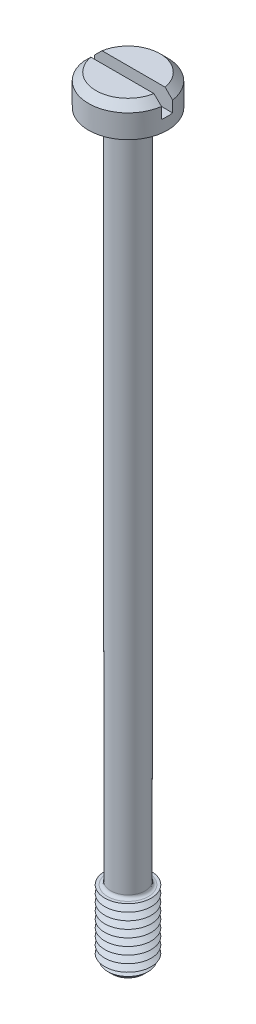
ISO-10303-21;
HEADER;
FILE_DESCRIPTION(('STEP AP214'),'2;1');
FILE_NAME('part.step','',(''),(''),'','','');
FILE_SCHEMA(('AUTOMOTIVE_DESIGN { 1 0 10303 214 1 1 1 1 }'));
ENDSEC;
DATA;
#1=APPLICATION_CONTEXT('core data for automotive mechanical design processes');
#2=APPLICATION_PROTOCOL_DEFINITION('international standard','automotive_design',2000,#1);
#3=PRODUCT_CONTEXT('',#1,'mechanical');
#4=PRODUCT('Part','Part','',(#3));
#5=PRODUCT_RELATED_PRODUCT_CATEGORY('part','',(#4));
#6=PRODUCT_DEFINITION_FORMATION('','',#4);
#7=PRODUCT_DEFINITION_CONTEXT('part definition',#1,'design');
#8=PRODUCT_DEFINITION('design','',#6,#7);
#9=PRODUCT_DEFINITION_SHAPE('','',#8);
#10=(LENGTH_UNIT() NAMED_UNIT(*) SI_UNIT(.MILLI.,.METRE.));
#11=(NAMED_UNIT(*) PLANE_ANGLE_UNIT() SI_UNIT($,.RADIAN.));
#12=(NAMED_UNIT(*) SI_UNIT($,.STERADIAN.) SOLID_ANGLE_UNIT());
#13=UNCERTAINTY_MEASURE_WITH_UNIT(LENGTH_MEASURE(1.E-05),#10,'distance_accuracy_value','');
#14=(GEOMETRIC_REPRESENTATION_CONTEXT(3) GLOBAL_UNCERTAINTY_ASSIGNED_CONTEXT((#13)) GLOBAL_UNIT_ASSIGNED_CONTEXT((#10,
#11,#12)) REPRESENTATION_CONTEXT('',''));
#15=CARTESIAN_POINT('',(0.,0.,0.));
#16=DIRECTION('',(0.,0.,1.));
#17=DIRECTION('',(1.,0.,0.));
#18=AXIS2_PLACEMENT_3D('',#15,#16,#17);
#19=CARTESIAN_POINT('',(0.,3.3,0.));
#20=DIRECTION('',(0.,1.,0.));
#21=DIRECTION('',(0.,0.,1.));
#22=AXIS2_PLACEMENT_3D('',#19,#20,#21);
#23=PLANE('',#22);
#24=DIRECTION('',(-1.,0.,0.));
#25=VECTOR('',#24,1.);
#26=CARTESIAN_POINT('',(4.25,3.3,-0.6));
#27=LINE('',#26,#25);
#28=CARTESIAN_POINT('',(3.39742549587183,3.3,-0.6));
#29=VERTEX_POINT('',#28);
#30=CARTESIAN_POINT('',(-3.39742549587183,3.3,-0.6));
#31=VERTEX_POINT('',#30);
#32=EDGE_CURVE('E110',#29,#31,#27,.T.);
#33=ORIENTED_EDGE('',*,*,#32,.F.);
#34=CARTESIAN_POINT('',(0.,3.3,0.));
#35=DIRECTION('',(0.,1.,0.));
#36=DIRECTION('',(0.,0.,1.));
#37=AXIS2_PLACEMENT_3D('',#34,#35,#36);
#38=CIRCLE('',#37,3.44999999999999);
#39=EDGE_CURVE('E113',#29,#31,#38,.T.);
#40=ORIENTED_EDGE('',*,*,#39,.T.);
#41=EDGE_LOOP('',(#33,#40));
#42=FACE_BOUND('',#41,.T.);
#43=ADVANCED_FACE('F39',(#42),#23,.T.);
#44=CARTESIAN_POINT('',(0.,3.3,0.));
#45=DIRECTION('',(0.,-1.,0.));
#46=DIRECTION('',(0.,0.,-1.));
#47=AXIS2_PLACEMENT_3D('',#44,#45,#46);
#48=CONICAL_SURFACE('',#47,3.44999999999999,0.785398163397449);
#49=CARTESIAN_POINT('',(9.35351408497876,-2.62273843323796,-0.6));
#50=CARTESIAN_POINT('',(9.03263557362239,-2.30252317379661,-0.6));
#51=CARTESIAN_POINT('',(8.7117281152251,-1.98233690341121,-0.6));
#52=CARTESIAN_POINT('',(8.069812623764,-1.34205341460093,-0.6));
#53=CARTESIAN_POINT('',(7.7488045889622,-1.02195619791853,-0.6));
#54=CARTESIAN_POINT('',(7.10652460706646,-0.381761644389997,-0.6));
#55=CARTESIAN_POINT('',(6.78525260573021,-0.0616643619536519,-0.6));
#56=CARTESIAN_POINT('',(6.14251393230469,0.578323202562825,-0.6));
#57=CARTESIAN_POINT('',(5.82104726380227,0.898213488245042,-0.6));
#58=CARTESIAN_POINT('',(5.1719620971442,1.54347500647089,-0.6));
#59=CARTESIAN_POINT('',(4.84433778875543,1.86884039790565,-0.6));
#60=CARTESIAN_POINT('',(4.35244442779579,2.35644593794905,-0.6));
#61=CARTESIAN_POINT('',(4.18839924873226,2.51891187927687,-0.6));
#62=CARTESIAN_POINT('',(3.86009606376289,2.84362679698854,-0.6));
#63=CARTESIAN_POINT('',(3.69583805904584,3.00587577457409,-0.6));
#64=CARTESIAN_POINT('',(3.36705354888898,3.33001661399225,-0.6));
#65=CARTESIAN_POINT('',(3.20252712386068,3.49190855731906,-0.6));
#66=CARTESIAN_POINT('',(2.87298689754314,3.81520272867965,-0.6));
#67=CARTESIAN_POINT('',(2.70797308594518,3.97660494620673,-0.6));
#68=CARTESIAN_POINT('',(2.37716903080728,4.29858210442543,-0.6));
#69=CARTESIAN_POINT('',(2.2113788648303,4.45915712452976,-0.6));
#70=CARTESIAN_POINT('',(1.96157219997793,4.6988460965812,-0.6));
#71=CARTESIAN_POINT('',(1.87811785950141,4.77854546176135,-0.6));
#72=CARTESIAN_POINT('',(1.71066064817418,4.93736532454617,-0.6));
#73=CARTESIAN_POINT('',(1.62665778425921,5.01648582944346,-0.6));
#74=CARTESIAN_POINT('',(1.49655488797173,5.13773269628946,-0.6));
#75=CARTESIAN_POINT('',(1.45074972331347,5.1801752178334,-0.6));
#76=CARTESIAN_POINT('',(1.35882119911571,5.26471614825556,-0.6));
#77=CARTESIAN_POINT('',(1.31269783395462,5.30681455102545,-0.6));
#78=CARTESIAN_POINT('',(1.22008852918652,5.39050695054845,-0.6));
#79=CARTESIAN_POINT('',(1.17360305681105,5.4321014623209,-0.6));
#80=CARTESIAN_POINT('',(1.08007401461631,5.51465347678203,-0.6));
#81=CARTESIAN_POINT('',(1.03303046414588,5.55561100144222,-0.6));
#82=CARTESIAN_POINT('',(0.919047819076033,5.65299331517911,-0.6));
#83=CARTESIAN_POINT('',(0.851738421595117,5.70899242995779,-0.6));
#84=CARTESIAN_POINT('',(0.748806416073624,5.79068526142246,-0.6));
#85=CARTESIAN_POINT('',(0.714125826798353,5.81756213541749,-0.6));
#86=CARTESIAN_POINT('',(0.643915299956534,5.87018079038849,-0.6));
#87=CARTESIAN_POINT('',(0.608385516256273,5.89592277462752,-0.6));
#88=CARTESIAN_POINT('',(0.545162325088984,5.93955652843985,-0.6));
#89=CARTESIAN_POINT('',(0.517718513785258,5.95780799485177,-0.6));
#90=CARTESIAN_POINT('',(0.462025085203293,5.99303174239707,-0.6));
#91=CARTESIAN_POINT('',(0.433775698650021,6.01000438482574,-0.6));
#92=CARTESIAN_POINT('',(0.376341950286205,6.04213837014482,-0.6));
#93=CARTESIAN_POINT('',(0.347160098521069,6.05730412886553,-0.6));
#94=CARTESIAN_POINT('',(0.287642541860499,6.0851339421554,-0.6));
#95=CARTESIAN_POINT('',(0.257308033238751,6.09780051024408,-0.6));
#96=CARTESIAN_POINT('',(0.190863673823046,6.12124627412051,-0.6));
#97=CARTESIAN_POINT('',(0.154554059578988,6.1314857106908,-0.6));
#98=CARTESIAN_POINT('',(0.0807909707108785,6.1456540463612,-0.6));
#99=CARTESIAN_POINT('',(0.0433423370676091,6.14960664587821,-0.6));
#100=CARTESIAN_POINT('',(-0.03179874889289,6.15033783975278,-0.6));
#101=CARTESIAN_POINT('',(-0.0694915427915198,6.14708428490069,-0.6));
#102=CARTESIAN_POINT('',(-0.143790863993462,6.13410921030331,-0.6));
#103=CARTESIAN_POINT('',(-0.180393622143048,6.1243674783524,-0.6));
#104=CARTESIAN_POINT('',(-0.254098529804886,6.09939647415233,-0.6));
#105=CARTESIAN_POINT('',(-0.291094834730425,6.0838685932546,-0.6));
#106=CARTESIAN_POINT('',(-0.363408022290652,6.0492466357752,-0.6));
#107=CARTESIAN_POINT('',(-0.398721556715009,6.03014579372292,-0.6));
#108=CARTESIAN_POINT('',(-0.468234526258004,5.98944452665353,-0.6));
#109=CARTESIAN_POINT('',(-0.502422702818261,5.96782521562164,-0.6));
#110=CARTESIAN_POINT('',(-0.569689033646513,5.92300618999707,-0.6));
#111=CARTESIAN_POINT('',(-0.602768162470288,5.89980792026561,-0.6));
#112=CARTESIAN_POINT('',(-0.671148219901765,5.85008963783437,-0.6));
#113=CARTESIAN_POINT('',(-0.706369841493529,5.82346130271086,-0.6));
#114=CARTESIAN_POINT('',(-0.776087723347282,5.76926828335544,-0.6));
#115=CARTESIAN_POINT('',(-0.810583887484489,5.74170347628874,-0.6));
#116=CARTESIAN_POINT('',(-0.913286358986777,5.6579827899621,-0.6));
#117=CARTESIAN_POINT('',(-0.98067372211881,5.60082541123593,-0.6));
#118=CARTESIAN_POINT('',(-1.11424616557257,5.48490670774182,-0.6));
#119=CARTESIAN_POINT('',(-1.18042891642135,5.42614273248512,-0.6));
#120=CARTESIAN_POINT('',(-1.31191262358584,5.30767463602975,-0.6));
#121=CARTESIAN_POINT('',(-1.37721382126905,5.24797078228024,-0.6));
#122=CARTESIAN_POINT('',(-1.50701089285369,5.12812906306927,-0.6));
#123=CARTESIAN_POINT('',(-1.57150872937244,5.06799331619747,-0.6));
#124=CARTESIAN_POINT('',(-1.70009132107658,4.94727328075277,-0.6));
#125=CARTESIAN_POINT('',(-1.76417604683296,4.88668896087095,-0.6));
#126=CARTESIAN_POINT('',(-1.95584105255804,4.70458824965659,-0.6));
#127=CARTESIAN_POINT('',(-2.08296922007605,4.58259645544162,-0.6));
#128=CARTESIAN_POINT('',(-2.33599178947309,4.33840625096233,-0.6));
#129=CARTESIAN_POINT('',(-2.46188913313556,4.21621087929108,-0.6));
#130=CARTESIAN_POINT('',(-2.71323511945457,3.97135925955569,-0.6));
#131=CARTESIAN_POINT('',(-2.83868376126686,3.84870301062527,-0.6));
#132=CARTESIAN_POINT('',(-3.21459106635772,3.48027743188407,-0.6));
#133=CARTESIAN_POINT('',(-3.46460626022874,3.23405597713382,-0.6));
#134=CARTESIAN_POINT('',(-3.96413793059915,2.74090313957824,-0.6));
#135=CARTESIAN_POINT('',(-4.21365415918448,2.49397150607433,-0.6));
#136=CARTESIAN_POINT('',(-4.71232475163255,1.9997473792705,-0.6));
#137=CARTESIAN_POINT('',(-4.96147911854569,1.75245488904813,-0.6));
#138=CARTESIAN_POINT('',(-5.45958725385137,1.25761544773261,-0.6));
#139=CARTESIAN_POINT('',(-5.70854099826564,1.01006847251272,-0.6));
#140=CARTESIAN_POINT('',(-6.20629498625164,0.514819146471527,-0.6));
#141=CARTESIAN_POINT('',(-6.45509522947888,0.267116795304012,-0.6));
#142=CARTESIAN_POINT('',(-7.20128563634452,-0.476100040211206,-0.6));
#143=CARTESIAN_POINT('',(-7.69851620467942,-0.971774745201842,-0.6));
#144=CARTESIAN_POINT('',(-8.38865115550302,-1.66007026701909,-0.6));
#145=CARTESIAN_POINT('',(-8.58165346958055,-1.85259293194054,-0.6));
#146=CARTESIAN_POINT('',(-8.87112736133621,-2.1413922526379,-0.6));
#147=CARTESIAN_POINT('',(-8.96761014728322,-2.23765767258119,-0.6));
#148=CARTESIAN_POINT('',(-9.16056764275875,-2.43019387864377,-0.6));
#149=CARTESIAN_POINT('',(-9.25704235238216,-2.52646466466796,-0.6));
#150=CARTESIAN_POINT('',(-9.35351408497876,-2.62273843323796,-0.6));
#151=B_SPLINE_CURVE_WITH_KNOTS('',3,(#49,#50,#51,#52,#53,#54,#55,#56,#57,#58,#59,#60,#61,#62,
#63,#64,#65,#66,#67,#68,#69,#70,#71,#72,#73,#74,#75,#76,#77,#78,#79,#80,#81,#82,#83,#84,#85,#86,
#87,#88,#89,#90,#91,#92,#93,#94,#95,#96,#97,#98,#99,#100,#101,#102,#103,#104,#105,#106,#107,
#108,#109,#110,#111,#112,#113,#114,#115,#116,#117,#118,#119,#120,#121,#122,#123,#124,#125,#126,
#127,#128,#129,#130,#131,#132,#133,#134,#135,#136,#137,#138,#139,#140,#141,#142,#143,#144,#145,
#146,#147,#148,#149,#150),.UNSPECIFIED.,.F.,.F.,(4,2,2,2,2,2,2,2,2,2,2,2,2,2,2,2,2,2,2,2,2,2,2,
2,2,2,2,2,2,2,2,2,2,2,2,2,2,2,2,2,2,2,2,2,2,2,2,2,2,2,4),(0.,1.35996600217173,2.71995696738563,
4.08050889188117,5.44103646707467,6.82624457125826,7.5188872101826,8.21152599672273,
8.90398568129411,9.59646011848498,10.288866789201,10.6350581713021,10.9812451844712,
11.1685812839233,11.3559207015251,11.5430489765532,11.7301707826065,11.9927784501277,
12.1243921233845,12.2559821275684,12.3548333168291,12.4536564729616,12.5522329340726,
12.6507097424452,12.763461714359,12.8757876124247,12.9886156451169,13.101796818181,
13.2218851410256,13.3422031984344,13.4634899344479,13.584667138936,13.7171086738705,
13.8495676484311,14.1146090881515,14.3801178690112,14.6455524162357,14.910099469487,
15.17466516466,15.7032346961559,16.2295761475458,16.755918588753,17.808623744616,
18.8617626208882,19.9148925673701,20.9681337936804,22.0213773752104,24.1276499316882,
24.9454725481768,25.3543534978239,25.7632286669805),.UNSPECIFIED.);
#152=CARTESIAN_POINT('',(4.20743389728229,2.5,-0.6));
#153=VERTEX_POINT('',#152);
#154=EDGE_CURVE('E268',#153,#29,#151,.T.);
#155=ORIENTED_EDGE('',*,*,#154,.F.);
#156=CARTESIAN_POINT('',(0.,2.5,0.));
#157=DIRECTION('',(0.,1.,0.));
#158=DIRECTION('',(0.,0.,1.));
#159=AXIS2_PLACEMENT_3D('',#156,#157,#158);
#160=CIRCLE('',#159,4.25);
#161=CARTESIAN_POINT('',(-4.20743389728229,2.49999999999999,-0.6));
#162=VERTEX_POINT('',#161);
#163=EDGE_CURVE('E128',#162,#153,#160,.F.);
#164=ORIENTED_EDGE('',*,*,#163,.F.);
#165=EDGE_CURVE('E102',#31,#162,#151,.T.);
#166=ORIENTED_EDGE('',*,*,#165,.F.);
#167=ORIENTED_EDGE('',*,*,#39,.F.);
#168=EDGE_LOOP('',(#155,#164,#166,#167));
#169=FACE_BOUND('',#168,.T.);
#170=ADVANCED_FACE('F230',(#169),#48,.T.);
#171=CARTESIAN_POINT('',(0.,-80.,0.));
#172=DIRECTION('',(0.,1.,0.));
#173=DIRECTION('',(0.,0.,1.));
#174=AXIS2_PLACEMENT_3D('',#171,#172,#173);
#175=CYLINDRICAL_SURFACE('',#174,1.85);
#176=CARTESIAN_POINT('',(0.,-72.15,0.));
#177=DIRECTION('',(0.,-1.,0.));
#178=DIRECTION('',(0.,0.,-1.));
#179=AXIS2_PLACEMENT_3D('',#176,#177,#178);
#180=CIRCLE('',#179,1.85);
#181=CARTESIAN_POINT('',(0.,-72.15,-1.85));
#182=VERTEX_POINT('',#181);
#183=EDGE_CURVE('E123',#182,#182,#180,.F.);
#184=ORIENTED_EDGE('',*,*,#183,.T.);
#185=EDGE_LOOP('',(#184));
#186=FACE_BOUND('',#185,.T.);
#187=CARTESIAN_POINT('',(0.,-0.350000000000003,0.));
#188=DIRECTION('',(0.,1.,0.));
#189=DIRECTION('',(0.,0.,1.));
#190=AXIS2_PLACEMENT_3D('',#187,#188,#189);
#191=CIRCLE('',#190,1.85);
#192=CARTESIAN_POINT('',(0.,-0.350000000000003,1.85));
#193=VERTEX_POINT('',#192);
#194=EDGE_CURVE('E381',#193,#193,#191,.F.);
#195=ORIENTED_EDGE('',*,*,#194,.T.);
#196=EDGE_LOOP('',(#195));
#197=FACE_BOUND('',#196,.T.);
#198=ADVANCED_FACE('F226',(#186,#197),#175,.T.);
#199=CARTESIAN_POINT('',(0.,3.3,0.));
#200=DIRECTION('',(0.,-1.,0.));
#201=DIRECTION('',(0.,0.,-1.));
#202=AXIS2_PLACEMENT_3D('',#199,#200,#201);
#203=CYLINDRICAL_SURFACE('',#202,4.25);
#204=ORIENTED_EDGE('',*,*,#163,.T.);
#205=DIRECTION('',(0.,-1.,0.));
#206=VECTOR('',#205,1.);
#207=CARTESIAN_POINT('',(4.20743389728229,3.3,-0.6));
#208=LINE('',#207,#206);
#209=CARTESIAN_POINT('',(4.20743389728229,1.3,-0.6));
#210=VERTEX_POINT('',#209);
#211=EDGE_CURVE('E64',#153,#210,#208,.T.);
#212=ORIENTED_EDGE('',*,*,#211,.T.);
#213=CARTESIAN_POINT('',(0.,1.3,0.));
#214=DIRECTION('',(0.,1.,0.));
#215=DIRECTION('',(0.,0.,1.));
#216=AXIS2_PLACEMENT_3D('',#213,#214,#215);
#217=CIRCLE('',#216,4.25);
#218=CARTESIAN_POINT('',(4.20743389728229,1.3,0.6));
#219=VERTEX_POINT('',#218);
#220=EDGE_CURVE('E11',#219,#210,#217,.T.);
#221=ORIENTED_EDGE('',*,*,#220,.F.);
#222=DIRECTION('',(0.,-1.,0.));
#223=VECTOR('',#222,1.);
#224=CARTESIAN_POINT('',(4.20743389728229,3.3,0.6));
#225=LINE('',#224,#223);
#226=CARTESIAN_POINT('',(4.20743389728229,2.49999999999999,0.6));
#227=VERTEX_POINT('',#226);
#228=EDGE_CURVE('E285',#219,#227,#225,.F.);
#229=ORIENTED_EDGE('',*,*,#228,.T.);
#230=CARTESIAN_POINT('',(-4.20743389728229,2.5,0.6));
#231=VERTEX_POINT('',#230);
#232=EDGE_CURVE('E120',#227,#231,#160,.F.);
#233=ORIENTED_EDGE('',*,*,#232,.T.);
#234=DIRECTION('',(0.,-1.,0.));
#235=VECTOR('',#234,1.);
#236=CARTESIAN_POINT('',(-4.20743389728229,3.3,0.6));
#237=LINE('',#236,#235);
#238=CARTESIAN_POINT('',(-4.20743389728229,1.3,0.6));
#239=VERTEX_POINT('',#238);
#240=EDGE_CURVE('E96',#231,#239,#237,.T.);
#241=ORIENTED_EDGE('',*,*,#240,.T.);
#242=CARTESIAN_POINT('',(-4.20743389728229,1.3,-0.6));
#243=VERTEX_POINT('',#242);
#244=EDGE_CURVE('E44',#243,#239,#217,.T.);
#245=ORIENTED_EDGE('',*,*,#244,.F.);
#246=DIRECTION('',(0.,-1.,0.));
#247=VECTOR('',#246,1.);
#248=CARTESIAN_POINT('',(-4.20743389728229,3.3,-0.6));
#249=LINE('',#248,#247);
#250=EDGE_CURVE('E288',#243,#162,#249,.F.);
#251=ORIENTED_EDGE('',*,*,#250,.T.);
#252=EDGE_LOOP('',(#204,#212,#221,#229,#233,#241,#245,#251));
#253=FACE_BOUND('',#252,.T.);
#254=CARTESIAN_POINT('',(0.,0.,0.));
#255=DIRECTION('',(0.,1.,0.));
#256=DIRECTION('',(0.,0.,1.));
#257=AXIS2_PLACEMENT_3D('',#254,#255,#256);
#258=CIRCLE('',#257,4.25);
#259=CARTESIAN_POINT('',(0.,0.,4.25));
#260=VERTEX_POINT('',#259);
#261=EDGE_CURVE('E366',#260,#260,#258,.T.);
#262=ORIENTED_EDGE('',*,*,#261,.T.);
#263=EDGE_LOOP('',(#262));
#264=FACE_BOUND('',#263,.T.);
#265=ADVANCED_FACE('F229',(#253,#264),#203,.T.);
#266=DIRECTION('',(1.,0.,0.));
#267=VECTOR('',#266,1.);
#268=CARTESIAN_POINT('',(4.25,3.3,0.6));
#269=LINE('',#268,#267);
#270=CARTESIAN_POINT('',(-3.39742549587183,3.3,0.6));
#271=VERTEX_POINT('',#270);
#272=CARTESIAN_POINT('',(3.39742549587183,3.3,0.6));
#273=VERTEX_POINT('',#272);
#274=EDGE_CURVE('E56',#271,#273,#269,.T.);
#275=ORIENTED_EDGE('',*,*,#274,.F.);
#276=EDGE_CURVE('E108',#271,#273,#38,.T.);
#277=ORIENTED_EDGE('',*,*,#276,.T.);
#278=EDGE_LOOP('',(#275,#277));
#279=FACE_BOUND('',#278,.T.);
#280=ADVANCED_FACE('F107',(#279),#23,.T.);
#281=CARTESIAN_POINT('',(0.,0.,0.));
#282=DIRECTION('',(0.,1.,0.));
#283=DIRECTION('',(0.,0.,1.));
#284=AXIS2_PLACEMENT_3D('',#281,#282,#283);
#285=PLANE('',#284);
#286=CARTESIAN_POINT('',(0.,0.,0.));
#287=DIRECTION('',(0.,1.,0.));
#288=DIRECTION('',(0.,0.,1.));
#289=AXIS2_PLACEMENT_3D('',#286,#287,#288);
#290=CIRCLE('',#289,2.2);
#291=CARTESIAN_POINT('',(0.,0.,2.2));
#292=VERTEX_POINT('',#291);
#293=EDGE_CURVE('E114',#292,#292,#290,.T.);
#294=ORIENTED_EDGE('',*,*,#293,.T.);
#295=EDGE_LOOP('',(#294));
#296=FACE_BOUND('',#295,.T.);
#297=ORIENTED_EDGE('',*,*,#261,.F.);
#298=EDGE_LOOP('',(#297));
#299=FACE_BOUND('',#298,.T.);
#300=ADVANCED_FACE('F220',(#296,#299),#285,.F.);
#301=CARTESIAN_POINT('',(0.,-72.5,0.));
#302=DIRECTION('',(0.,-1.,0.));
#303=DIRECTION('',(0.,0.,-1.));
#304=AXIS2_PLACEMENT_3D('',#301,#302,#303);
#305=PLANE('',#304);
#306=CARTESIAN_POINT('',(0.,-72.5,0.));
#307=DIRECTION('',(0.,-1.,0.));
#308=DIRECTION('',(0.,0.,-1.));
#309=AXIS2_PLACEMENT_3D('',#306,#307,#308);
#310=CIRCLE('',#309,2.2);
#311=CARTESIAN_POINT('',(0.,-72.5,-2.2));
#312=VERTEX_POINT('',#311);
#313=EDGE_CURVE('E374',#312,#312,#310,.T.);
#314=ORIENTED_EDGE('',*,*,#313,.T.);
#315=EDGE_LOOP('',(#314));
#316=FACE_BOUND('',#315,.T.);
#317=CARTESIAN_POINT('',(0.,-72.5,0.));
#318=DIRECTION('',(0.,1.,0.));
#319=DIRECTION('',(0.,0.,1.));
#320=AXIS2_PLACEMENT_3D('',#317,#318,#319);
#321=CIRCLE('',#320,2.5);
#322=CARTESIAN_POINT('',(0.,-72.5,2.5));
#323=VERTEX_POINT('',#322);
#324=EDGE_CURVE('E362',#323,#323,#321,.T.);
#325=ORIENTED_EDGE('',*,*,#324,.T.);
#326=EDGE_LOOP('',(#325));
#327=FACE_BOUND('',#326,.T.);
#328=ADVANCED_FACE('F216',(#316,#327),#305,.F.);
#329=CARTESIAN_POINT('',(0.,-72.9,0.));
#330=DIRECTION('',(0.,1.,0.));
#331=DIRECTION('',(0.,0.,1.));
#332=AXIS2_PLACEMENT_3D('',#329,#330,#331);
#333=CONICAL_SURFACE('',#332,1.80717967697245,1.04719755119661);
#334=ORIENTED_EDGE('',*,*,#324,.F.);
#335=EDGE_LOOP('',(#334));
#336=FACE_BOUND('',#335,.T.);
#337=CARTESIAN_POINT('',(0.,-72.9,0.));
#338=DIRECTION('',(0.,1.,0.));
#339=DIRECTION('',(0.,0.,1.));
#340=AXIS2_PLACEMENT_3D('',#337,#338,#339);
#341=CIRCLE('',#340,1.80717967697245);
#342=CARTESIAN_POINT('',(0.,-72.9,1.80717967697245));
#343=VERTEX_POINT('',#342);
#344=EDGE_CURVE('E359',#343,#343,#341,.T.);
#345=ORIENTED_EDGE('',*,*,#344,.T.);
#346=EDGE_LOOP('',(#345));
#347=FACE_BOUND('',#346,.T.);
#348=ADVANCED_FACE('F212',(#336,#347),#333,.T.);
#349=CARTESIAN_POINT('',(0.,-73.3,0.));
#350=DIRECTION('',(0.,-1.,0.));
#351=DIRECTION('',(0.,0.,-1.));
#352=AXIS2_PLACEMENT_3D('',#349,#350,#351);
#353=CONICAL_SURFACE('',#352,2.5,1.04719755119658);
#354=ORIENTED_EDGE('',*,*,#344,.F.);
#355=EDGE_LOOP('',(#354));
#356=FACE_BOUND('',#355,.T.);
#357=CARTESIAN_POINT('',(0.,-73.3,0.));
#358=DIRECTION('',(0.,1.,0.));
#359=DIRECTION('',(0.,0.,1.));
#360=AXIS2_PLACEMENT_3D('',#357,#358,#359);
#361=CIRCLE('',#360,2.5);
#362=CARTESIAN_POINT('',(0.,-73.3,2.5));
#363=VERTEX_POINT('',#362);
#364=EDGE_CURVE('E355',#363,#363,#361,.T.);
#365=ORIENTED_EDGE('',*,*,#364,.T.);
#366=EDGE_LOOP('',(#365));
#367=FACE_BOUND('',#366,.T.);
#368=ADVANCED_FACE('F208',(#356,#367),#353,.T.);
#369=CARTESIAN_POINT('',(0.,-73.7,0.));
#370=DIRECTION('',(0.,1.,0.));
#371=DIRECTION('',(0.,0.,1.));
#372=AXIS2_PLACEMENT_3D('',#369,#370,#371);
#373=CONICAL_SURFACE('',#372,1.80717967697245,1.04719755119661);
#374=ORIENTED_EDGE('',*,*,#364,.F.);
#375=EDGE_LOOP('',(#374));
#376=FACE_BOUND('',#375,.T.);
#377=CARTESIAN_POINT('',(0.,-73.7,0.));
#378=DIRECTION('',(0.,1.,0.));
#379=DIRECTION('',(0.,0.,1.));
#380=AXIS2_PLACEMENT_3D('',#377,#378,#379);
#381=CIRCLE('',#380,1.80717967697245);
#382=CARTESIAN_POINT('',(0.,-73.7,1.80717967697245));
#383=VERTEX_POINT('',#382);
#384=EDGE_CURVE('E352',#383,#383,#381,.T.);
#385=ORIENTED_EDGE('',*,*,#384,.T.);
#386=EDGE_LOOP('',(#385));
#387=FACE_BOUND('',#386,.T.);
#388=ADVANCED_FACE('F204',(#376,#387),#373,.T.);
#389=CARTESIAN_POINT('',(0.,-74.1,0.));
#390=DIRECTION('',(0.,-1.,0.));
#391=DIRECTION('',(0.,0.,-1.));
#392=AXIS2_PLACEMENT_3D('',#389,#390,#391);
#393=CONICAL_SURFACE('',#392,2.5,1.04719755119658);
#394=ORIENTED_EDGE('',*,*,#384,.F.);
#395=EDGE_LOOP('',(#394));
#396=FACE_BOUND('',#395,.T.);
#397=CARTESIAN_POINT('',(0.,-74.1,0.));
#398=DIRECTION('',(0.,1.,0.));
#399=DIRECTION('',(0.,0.,1.));
#400=AXIS2_PLACEMENT_3D('',#397,#398,#399);
#401=CIRCLE('',#400,2.5);
#402=CARTESIAN_POINT('',(0.,-74.1,2.5));
#403=VERTEX_POINT('',#402);
#404=EDGE_CURVE('E348',#403,#403,#401,.T.);
#405=ORIENTED_EDGE('',*,*,#404,.T.);
#406=EDGE_LOOP('',(#405));
#407=FACE_BOUND('',#406,.T.);
#408=ADVANCED_FACE('F200',(#396,#407),#393,.T.);
#409=CARTESIAN_POINT('',(0.,-74.5,0.));
#410=DIRECTION('',(0.,1.,0.));
#411=DIRECTION('',(0.,0.,1.));
#412=AXIS2_PLACEMENT_3D('',#409,#410,#411);
#413=CONICAL_SURFACE('',#412,1.80717967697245,1.04719755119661);
#414=ORIENTED_EDGE('',*,*,#404,.F.);
#415=EDGE_LOOP('',(#414));
#416=FACE_BOUND('',#415,.T.);
#417=CARTESIAN_POINT('',(0.,-74.5,0.));
#418=DIRECTION('',(0.,1.,0.));
#419=DIRECTION('',(0.,0.,1.));
#420=AXIS2_PLACEMENT_3D('',#417,#418,#419);
#421=CIRCLE('',#420,1.80717967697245);
#422=CARTESIAN_POINT('',(0.,-74.5,1.80717967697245));
#423=VERTEX_POINT('',#422);
#424=EDGE_CURVE('E344',#423,#423,#421,.T.);
#425=ORIENTED_EDGE('',*,*,#424,.T.);
#426=EDGE_LOOP('',(#425));
#427=FACE_BOUND('',#426,.T.);
#428=ADVANCED_FACE('F196',(#416,#427),#413,.T.);
#429=CARTESIAN_POINT('',(0.,-74.9,0.));
#430=DIRECTION('',(0.,-1.,0.));
#431=DIRECTION('',(0.,0.,-1.));
#432=AXIS2_PLACEMENT_3D('',#429,#430,#431);
#433=CONICAL_SURFACE('',#432,2.5,1.04719755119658);
#434=ORIENTED_EDGE('',*,*,#424,.F.);
#435=EDGE_LOOP('',(#434));
#436=FACE_BOUND('',#435,.T.);
#437=CARTESIAN_POINT('',(0.,-74.9,0.));
#438=DIRECTION('',(0.,1.,0.));
#439=DIRECTION('',(0.,0.,1.));
#440=AXIS2_PLACEMENT_3D('',#437,#438,#439);
#441=CIRCLE('',#440,2.5);
#442=CARTESIAN_POINT('',(0.,-74.9,2.5));
#443=VERTEX_POINT('',#442);
#444=EDGE_CURVE('E341',#443,#443,#441,.T.);
#445=ORIENTED_EDGE('',*,*,#444,.T.);
#446=EDGE_LOOP('',(#445));
#447=FACE_BOUND('',#446,.T.);
#448=ADVANCED_FACE('F192',(#436,#447),#433,.T.);
#449=CARTESIAN_POINT('',(0.,-75.3,0.));
#450=DIRECTION('',(0.,1.,0.));
#451=DIRECTION('',(0.,0.,1.));
#452=AXIS2_PLACEMENT_3D('',#449,#450,#451);
#453=CONICAL_SURFACE('',#452,1.80717967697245,1.04719755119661);
#454=ORIENTED_EDGE('',*,*,#444,.F.);
#455=EDGE_LOOP('',(#454));
#456=FACE_BOUND('',#455,.T.);
#457=CARTESIAN_POINT('',(0.,-75.3,0.));
#458=DIRECTION('',(0.,1.,0.));
#459=DIRECTION('',(0.,0.,1.));
#460=AXIS2_PLACEMENT_3D('',#457,#458,#459);
#461=CIRCLE('',#460,1.80717967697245);
#462=CARTESIAN_POINT('',(0.,-75.3,1.80717967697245));
#463=VERTEX_POINT('',#462);
#464=EDGE_CURVE('E337',#463,#463,#461,.T.);
#465=ORIENTED_EDGE('',*,*,#464,.T.);
#466=EDGE_LOOP('',(#465));
#467=FACE_BOUND('',#466,.T.);
#468=ADVANCED_FACE('F188',(#456,#467),#453,.T.);
#469=CARTESIAN_POINT('',(0.,-75.7,0.));
#470=DIRECTION('',(0.,-1.,0.));
#471=DIRECTION('',(0.,0.,-1.));
#472=AXIS2_PLACEMENT_3D('',#469,#470,#471);
#473=CONICAL_SURFACE('',#472,2.5,1.04719755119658);
#474=ORIENTED_EDGE('',*,*,#464,.F.);
#475=EDGE_LOOP('',(#474));
#476=FACE_BOUND('',#475,.T.);
#477=CARTESIAN_POINT('',(0.,-75.7,0.));
#478=DIRECTION('',(0.,1.,0.));
#479=DIRECTION('',(0.,0.,1.));
#480=AXIS2_PLACEMENT_3D('',#477,#478,#479);
#481=CIRCLE('',#480,2.5);
#482=CARTESIAN_POINT('',(0.,-75.7,2.5));
#483=VERTEX_POINT('',#482);
#484=EDGE_CURVE('E334',#483,#483,#481,.T.);
#485=ORIENTED_EDGE('',*,*,#484,.T.);
#486=EDGE_LOOP('',(#485));
#487=FACE_BOUND('',#486,.T.);
#488=ADVANCED_FACE('F184',(#476,#487),#473,.T.);
#489=CARTESIAN_POINT('',(0.,-76.1,0.));
#490=DIRECTION('',(0.,1.,0.));
#491=DIRECTION('',(0.,0.,1.));
#492=AXIS2_PLACEMENT_3D('',#489,#490,#491);
#493=CONICAL_SURFACE('',#492,1.80717967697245,1.04719755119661);
#494=ORIENTED_EDGE('',*,*,#484,.F.);
#495=EDGE_LOOP('',(#494));
#496=FACE_BOUND('',#495,.T.);
#497=CARTESIAN_POINT('',(0.,-76.1,0.));
#498=DIRECTION('',(0.,1.,0.));
#499=DIRECTION('',(0.,0.,1.));
#500=AXIS2_PLACEMENT_3D('',#497,#498,#499);
#501=CIRCLE('',#500,1.80717967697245);
#502=CARTESIAN_POINT('',(0.,-76.1,1.80717967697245));
#503=VERTEX_POINT('',#502);
#504=EDGE_CURVE('E330',#503,#503,#501,.T.);
#505=ORIENTED_EDGE('',*,*,#504,.T.);
#506=EDGE_LOOP('',(#505));
#507=FACE_BOUND('',#506,.T.);
#508=ADVANCED_FACE('F180',(#496,#507),#493,.T.);
#509=CARTESIAN_POINT('',(0.,-76.5,0.));
#510=DIRECTION('',(0.,-1.,0.));
#511=DIRECTION('',(0.,0.,-1.));
#512=AXIS2_PLACEMENT_3D('',#509,#510,#511);
#513=CONICAL_SURFACE('',#512,2.5,1.04719755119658);
#514=ORIENTED_EDGE('',*,*,#504,.F.);
#515=EDGE_LOOP('',(#514));
#516=FACE_BOUND('',#515,.T.);
#517=CARTESIAN_POINT('',(0.,-76.5,0.));
#518=DIRECTION('',(0.,1.,0.));
#519=DIRECTION('',(0.,0.,1.));
#520=AXIS2_PLACEMENT_3D('',#517,#518,#519);
#521=CIRCLE('',#520,2.5);
#522=CARTESIAN_POINT('',(0.,-76.5,2.5));
#523=VERTEX_POINT('',#522);
#524=EDGE_CURVE('E326',#523,#523,#521,.T.);
#525=ORIENTED_EDGE('',*,*,#524,.T.);
#526=EDGE_LOOP('',(#525));
#527=FACE_BOUND('',#526,.T.);
#528=ADVANCED_FACE('F176',(#516,#527),#513,.T.);
#529=CARTESIAN_POINT('',(0.,-76.9,0.));
#530=DIRECTION('',(0.,1.,0.));
#531=DIRECTION('',(0.,0.,1.));
#532=AXIS2_PLACEMENT_3D('',#529,#530,#531);
#533=CONICAL_SURFACE('',#532,1.80717967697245,1.04719755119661);
#534=ORIENTED_EDGE('',*,*,#524,.F.);
#535=EDGE_LOOP('',(#534));
#536=FACE_BOUND('',#535,.T.);
#537=CARTESIAN_POINT('',(0.,-76.9,0.));
#538=DIRECTION('',(0.,1.,0.));
#539=DIRECTION('',(0.,0.,1.));
#540=AXIS2_PLACEMENT_3D('',#537,#538,#539);
#541=CIRCLE('',#540,1.80717967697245);
#542=CARTESIAN_POINT('',(0.,-76.9,1.80717967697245));
#543=VERTEX_POINT('',#542);
#544=EDGE_CURVE('E322',#543,#543,#541,.T.);
#545=ORIENTED_EDGE('',*,*,#544,.T.);
#546=EDGE_LOOP('',(#545));
#547=FACE_BOUND('',#546,.T.);
#548=ADVANCED_FACE('F172',(#536,#547),#533,.T.);
#549=CARTESIAN_POINT('',(0.,-77.3,0.));
#550=DIRECTION('',(0.,-1.,0.));
#551=DIRECTION('',(0.,0.,-1.));
#552=AXIS2_PLACEMENT_3D('',#549,#550,#551);
#553=CONICAL_SURFACE('',#552,2.5,1.04719755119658);
#554=ORIENTED_EDGE('',*,*,#544,.F.);
#555=EDGE_LOOP('',(#554));
#556=FACE_BOUND('',#555,.T.);
#557=CARTESIAN_POINT('',(0.,-77.3,0.));
#558=DIRECTION('',(0.,1.,0.));
#559=DIRECTION('',(0.,0.,1.));
#560=AXIS2_PLACEMENT_3D('',#557,#558,#559);
#561=CIRCLE('',#560,2.5);
#562=CARTESIAN_POINT('',(0.,-77.3,2.5));
#563=VERTEX_POINT('',#562);
#564=EDGE_CURVE('E318',#563,#563,#561,.T.);
#565=ORIENTED_EDGE('',*,*,#564,.T.);
#566=EDGE_LOOP('',(#565));
#567=FACE_BOUND('',#566,.T.);
#568=ADVANCED_FACE('F168',(#556,#567),#553,.T.);
#569=CARTESIAN_POINT('',(0.,-77.7,0.));
#570=DIRECTION('',(0.,1.,0.));
#571=DIRECTION('',(0.,0.,1.));
#572=AXIS2_PLACEMENT_3D('',#569,#570,#571);
#573=CONICAL_SURFACE('',#572,1.80717967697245,1.04719755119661);
#574=ORIENTED_EDGE('',*,*,#564,.F.);
#575=EDGE_LOOP('',(#574));
#576=FACE_BOUND('',#575,.T.);
#577=CARTESIAN_POINT('',(0.,-77.7,0.));
#578=DIRECTION('',(0.,1.,0.));
#579=DIRECTION('',(0.,0.,1.));
#580=AXIS2_PLACEMENT_3D('',#577,#578,#579);
#581=CIRCLE('',#580,1.80717967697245);
#582=CARTESIAN_POINT('',(0.,-77.7,1.80717967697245));
#583=VERTEX_POINT('',#582);
#584=EDGE_CURVE('E314',#583,#583,#581,.T.);
#585=ORIENTED_EDGE('',*,*,#584,.T.);
#586=EDGE_LOOP('',(#585));
#587=FACE_BOUND('',#586,.T.);
#588=ADVANCED_FACE('F164',(#576,#587),#573,.T.);
#589=CARTESIAN_POINT('',(0.,-78.1,0.));
#590=DIRECTION('',(0.,-1.,0.));
#591=DIRECTION('',(0.,0.,-1.));
#592=AXIS2_PLACEMENT_3D('',#589,#590,#591);
#593=CONICAL_SURFACE('',#592,2.5,1.04719755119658);
#594=ORIENTED_EDGE('',*,*,#584,.F.);
#595=EDGE_LOOP('',(#594));
#596=FACE_BOUND('',#595,.T.);
#597=CARTESIAN_POINT('',(0.,-78.1,0.));
#598=DIRECTION('',(0.,1.,0.));
#599=DIRECTION('',(0.,0.,1.));
#600=AXIS2_PLACEMENT_3D('',#597,#598,#599);
#601=CIRCLE('',#600,2.5);
#602=CARTESIAN_POINT('',(0.,-78.1,2.5));
#603=VERTEX_POINT('',#602);
#604=EDGE_CURVE('E310',#603,#603,#601,.T.);
#605=ORIENTED_EDGE('',*,*,#604,.T.);
#606=EDGE_LOOP('',(#605));
#607=FACE_BOUND('',#606,.T.);
#608=ADVANCED_FACE('F160',(#596,#607),#593,.T.);
#609=CARTESIAN_POINT('',(0.,-78.5,0.));
#610=DIRECTION('',(0.,1.,0.));
#611=DIRECTION('',(0.,0.,1.));
#612=AXIS2_PLACEMENT_3D('',#609,#610,#611);
#613=CONICAL_SURFACE('',#612,1.80717967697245,1.04719755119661);
#614=ORIENTED_EDGE('',*,*,#604,.F.);
#615=EDGE_LOOP('',(#614));
#616=FACE_BOUND('',#615,.T.);
#617=CARTESIAN_POINT('',(0.,-78.5,0.));
#618=DIRECTION('',(0.,1.,0.));
#619=DIRECTION('',(0.,0.,1.));
#620=AXIS2_PLACEMENT_3D('',#617,#618,#619);
#621=CIRCLE('',#620,1.80717967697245);
#622=CARTESIAN_POINT('',(0.,-78.5,1.80717967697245));
#623=VERTEX_POINT('',#622);
#624=EDGE_CURVE('E306',#623,#623,#621,.T.);
#625=ORIENTED_EDGE('',*,*,#624,.T.);
#626=EDGE_LOOP('',(#625));
#627=FACE_BOUND('',#626,.T.);
#628=ADVANCED_FACE('F156',(#616,#627),#613,.T.);
#629=CARTESIAN_POINT('',(0.,-78.9,0.));
#630=DIRECTION('',(0.,-1.,0.));
#631=DIRECTION('',(0.,0.,-1.));
#632=AXIS2_PLACEMENT_3D('',#629,#630,#631);
#633=CONICAL_SURFACE('',#632,2.5,1.04719755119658);
#634=ORIENTED_EDGE('',*,*,#624,.F.);
#635=EDGE_LOOP('',(#634));
#636=FACE_BOUND('',#635,.T.);
#637=CARTESIAN_POINT('',(0.,-78.9,0.));
#638=DIRECTION('',(0.,1.,0.));
#639=DIRECTION('',(0.,0.,1.));
#640=AXIS2_PLACEMENT_3D('',#637,#638,#639);
#641=CIRCLE('',#640,2.5);
#642=CARTESIAN_POINT('',(0.,-78.9,2.5));
#643=VERTEX_POINT('',#642);
#644=EDGE_CURVE('E301',#643,#643,#641,.T.);
#645=ORIENTED_EDGE('',*,*,#644,.T.);
#646=EDGE_LOOP('',(#645));
#647=FACE_BOUND('',#646,.T.);
#648=ADVANCED_FACE('F152',(#636,#647),#633,.T.);
#649=CARTESIAN_POINT('',(0.,-79.3,0.));
#650=DIRECTION('',(0.,1.,0.));
#651=DIRECTION('',(0.,0.,1.));
#652=AXIS2_PLACEMENT_3D('',#649,#650,#651);
#653=CONICAL_SURFACE('',#652,1.80717967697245,1.04719755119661);
#654=ORIENTED_EDGE('',*,*,#644,.F.);
#655=EDGE_LOOP('',(#654));
#656=FACE_BOUND('',#655,.T.);
#657=CARTESIAN_POINT('',(0.,-79.3,0.));
#658=DIRECTION('',(0.,1.,0.));
#659=DIRECTION('',(0.,0.,1.));
#660=AXIS2_PLACEMENT_3D('',#657,#658,#659);
#661=CIRCLE('',#660,1.80717967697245);
#662=CARTESIAN_POINT('',(0.,-79.3,1.80717967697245));
#663=VERTEX_POINT('',#662);
#664=EDGE_CURVE('E298',#663,#663,#661,.T.);
#665=ORIENTED_EDGE('',*,*,#664,.T.);
#666=EDGE_LOOP('',(#665));
#667=FACE_BOUND('',#666,.T.);
#668=ADVANCED_FACE('F148',(#656,#667),#653,.T.);
#669=CARTESIAN_POINT('',(0.,-79.7,0.));
#670=DIRECTION('',(0.,-1.,0.));
#671=DIRECTION('',(0.,0.,-1.));
#672=AXIS2_PLACEMENT_3D('',#669,#670,#671);
#673=CONICAL_SURFACE('',#672,2.5,1.04719755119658);
#674=CARTESIAN_POINT('',(0.,-79.5169872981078,0.));
#675=DIRECTION('',(0.,-1.,0.));
#676=DIRECTION('',(0.,0.,-1.));
#677=AXIS2_PLACEMENT_3D('',#674,#675,#676);
#678=CIRCLE('',#677,2.18301270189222);
#679=CARTESIAN_POINT('',(0.,-79.5169872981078,-2.18301270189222));
#680=VERTEX_POINT('',#679);
#681=EDGE_CURVE('E305',#680,#680,#678,.F.);
#682=ORIENTED_EDGE('',*,*,#681,.T.);
#683=EDGE_LOOP('',(#682));
#684=FACE_BOUND('',#683,.T.);
#685=ORIENTED_EDGE('',*,*,#664,.F.);
#686=EDGE_LOOP('',(#685));
#687=FACE_BOUND('',#686,.T.);
#688=ADVANCED_FACE('F144',(#684,#687),#673,.T.);
#689=CARTESIAN_POINT('',(0.,-80.,0.));
#690=DIRECTION('',(0.,-1.,0.));
#691=DIRECTION('',(0.,0.,-1.));
#692=AXIS2_PLACEMENT_3D('',#689,#690,#691);
#693=PLANE('',#692);
#694=CARTESIAN_POINT('',(0.,-80.,0.));
#695=DIRECTION('',(0.,-1.,0.));
#696=DIRECTION('',(0.,0.,-1.));
#697=AXIS2_PLACEMENT_3D('',#694,#695,#696);
#698=CIRCLE('',#697,1.7);
#699=CARTESIAN_POINT('',(0.,-80.,-1.7));
#700=VERTEX_POINT('',#699);
#701=EDGE_CURVE('E370',#700,#700,#698,.T.);
#702=ORIENTED_EDGE('',*,*,#701,.T.);
#703=EDGE_LOOP('',(#702));
#704=FACE_BOUND('',#703,.T.);
#705=ADVANCED_FACE('F147',(#704),#693,.T.);
#706=CARTESIAN_POINT('',(0.,-80.,0.));
#707=DIRECTION('',(0.,1.,0.));
#708=DIRECTION('',(0.,0.,1.));
#709=AXIS2_PLACEMENT_3D('',#706,#707,#708);
#710=CONICAL_SURFACE('',#709,1.7,0.785398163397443);
#711=ORIENTED_EDGE('',*,*,#681,.F.);
#712=EDGE_LOOP('',(#711));
#713=FACE_BOUND('',#712,.T.);
#714=ORIENTED_EDGE('',*,*,#701,.F.);
#715=EDGE_LOOP('',(#714));
#716=FACE_BOUND('',#715,.T.);
#717=ADVANCED_FACE('F224',(#713,#716),#710,.T.);
#718=CARTESIAN_POINT('',(0.,-72.15,0.));
#719=DIRECTION('',(0.,-1.,0.));
#720=DIRECTION('',(0.,0.,-1.));
#721=AXIS2_PLACEMENT_3D('',#718,#719,#720);
#722=TOROIDAL_SURFACE('',#721,2.2,0.35);
#723=ORIENTED_EDGE('',*,*,#183,.F.);
#724=EDGE_LOOP('',(#723));
#725=FACE_BOUND('',#724,.T.);
#726=ORIENTED_EDGE('',*,*,#313,.F.);
#727=EDGE_LOOP('',(#726));
#728=FACE_BOUND('',#727,.T.);
#729=ADVANCED_FACE('F242',(#725,#728),#722,.F.);
#730=CARTESIAN_POINT('',(0.,-0.350000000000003,0.));
#731=DIRECTION('',(0.,1.,0.));
#732=DIRECTION('',(0.,0.,1.));
#733=AXIS2_PLACEMENT_3D('',#730,#731,#732);
#734=TOROIDAL_SURFACE('',#733,2.2,0.35);
#735=ORIENTED_EDGE('',*,*,#293,.F.);
#736=EDGE_LOOP('',(#735));
#737=FACE_BOUND('',#736,.T.);
#738=ORIENTED_EDGE('',*,*,#194,.F.);
#739=EDGE_LOOP('',(#738));
#740=FACE_BOUND('',#739,.T.);
#741=ADVANCED_FACE('F245',(#737,#740),#734,.F.);
#742=CARTESIAN_POINT('',(-9.35351408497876,-2.62273843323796,0.6));
#743=CARTESIAN_POINT('',(-9.03263557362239,-2.30252317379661,0.6));
#744=CARTESIAN_POINT('',(-8.7117281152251,-1.98233690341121,0.6));
#745=CARTESIAN_POINT('',(-8.069812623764,-1.34205341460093,0.6));
#746=CARTESIAN_POINT('',(-7.7488045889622,-1.02195619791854,0.6));
#747=CARTESIAN_POINT('',(-7.10652460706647,-0.381761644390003,0.6));
#748=CARTESIAN_POINT('',(-6.78525260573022,-0.0616643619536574,0.6));
#749=CARTESIAN_POINT('',(-6.1425139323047,0.578323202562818,0.6));
#750=CARTESIAN_POINT('',(-5.82104726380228,0.898213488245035,0.6));
#751=CARTESIAN_POINT('',(-5.17196209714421,1.54347500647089,0.6));
#752=CARTESIAN_POINT('',(-4.84433778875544,1.86884039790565,0.6));
#753=CARTESIAN_POINT('',(-4.35244442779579,2.35644593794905,0.6));
#754=CARTESIAN_POINT('',(-4.18839924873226,2.51891187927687,0.6));
#755=CARTESIAN_POINT('',(-3.86009606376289,2.84362679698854,0.6));
#756=CARTESIAN_POINT('',(-3.69583805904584,3.00587577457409,0.6));
#757=CARTESIAN_POINT('',(-3.36705354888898,3.33001661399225,0.6));
#758=CARTESIAN_POINT('',(-3.20252712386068,3.49190855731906,0.6));
#759=CARTESIAN_POINT('',(-2.87298689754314,3.81520272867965,0.6));
#760=CARTESIAN_POINT('',(-2.70797308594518,3.97660494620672,0.6));
#761=CARTESIAN_POINT('',(-2.37716903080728,4.29858210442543,0.6));
#762=CARTESIAN_POINT('',(-2.2113788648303,4.45915712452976,0.6));
#763=CARTESIAN_POINT('',(-1.96157219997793,4.6988460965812,0.6));
#764=CARTESIAN_POINT('',(-1.87811785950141,4.77854546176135,0.6));
#765=CARTESIAN_POINT('',(-1.71066064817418,4.93736532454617,0.6));
#766=CARTESIAN_POINT('',(-1.62665778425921,5.01648582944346,0.6));
#767=CARTESIAN_POINT('',(-1.49655488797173,5.13773269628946,0.6));
#768=CARTESIAN_POINT('',(-1.45074972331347,5.1801752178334,0.6));
#769=CARTESIAN_POINT('',(-1.35882119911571,5.26471614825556,0.6));
#770=CARTESIAN_POINT('',(-1.31269783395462,5.30681455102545,0.6));
#771=CARTESIAN_POINT('',(-1.22008852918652,5.39050695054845,0.6));
#772=CARTESIAN_POINT('',(-1.17360305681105,5.43210146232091,0.6));
#773=CARTESIAN_POINT('',(-1.08007401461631,5.51465347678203,0.6));
#774=CARTESIAN_POINT('',(-1.03303046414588,5.55561100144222,0.6));
#775=CARTESIAN_POINT('',(-0.919047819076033,5.65299331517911,0.6));
#776=CARTESIAN_POINT('',(-0.851738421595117,5.70899242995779,0.6));
#777=CARTESIAN_POINT('',(-0.748806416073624,5.79068526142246,0.6));
#778=CARTESIAN_POINT('',(-0.714125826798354,5.81756213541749,0.6));
#779=CARTESIAN_POINT('',(-0.643915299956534,5.87018079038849,0.6));
#780=CARTESIAN_POINT('',(-0.608385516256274,5.89592277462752,0.6));
#781=CARTESIAN_POINT('',(-0.545162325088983,5.93955652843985,0.6));
#782=CARTESIAN_POINT('',(-0.517718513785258,5.95780799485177,0.6));
#783=CARTESIAN_POINT('',(-0.462025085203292,5.99303174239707,0.6));
#784=CARTESIAN_POINT('',(-0.433775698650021,6.01000438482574,0.6));
#785=CARTESIAN_POINT('',(-0.376341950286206,6.04213837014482,0.6));
#786=CARTESIAN_POINT('',(-0.34716009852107,6.05730412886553,0.6));
#787=CARTESIAN_POINT('',(-0.2876425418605,6.0851339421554,0.6));
#788=CARTESIAN_POINT('',(-0.257308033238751,6.09780051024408,0.6));
#789=CARTESIAN_POINT('',(-0.190863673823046,6.12124627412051,0.6));
#790=CARTESIAN_POINT('',(-0.154554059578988,6.1314857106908,0.6));
#791=CARTESIAN_POINT('',(-0.0807909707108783,6.1456540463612,0.6));
#792=CARTESIAN_POINT('',(-0.043342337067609,6.14960664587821,0.6));
#793=CARTESIAN_POINT('',(0.0317987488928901,6.15033783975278,0.6));
#794=CARTESIAN_POINT('',(0.0694915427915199,6.14708428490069,0.6));
#795=CARTESIAN_POINT('',(0.143790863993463,6.13410921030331,0.6));
#796=CARTESIAN_POINT('',(0.180393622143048,6.1243674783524,0.6));
#797=CARTESIAN_POINT('',(0.254098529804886,6.09939647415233,0.6));
#798=CARTESIAN_POINT('',(0.291094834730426,6.0838685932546,0.6));
#799=CARTESIAN_POINT('',(0.363408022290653,6.0492466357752,0.6));
#800=CARTESIAN_POINT('',(0.39872155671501,6.03014579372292,0.6));
#801=CARTESIAN_POINT('',(0.468234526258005,5.98944452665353,0.6));
#802=CARTESIAN_POINT('',(0.502422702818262,5.96782521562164,0.6));
#803=CARTESIAN_POINT('',(0.569689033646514,5.92300618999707,0.6));
#804=CARTESIAN_POINT('',(0.602768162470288,5.89980792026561,0.6));
#805=CARTESIAN_POINT('',(0.671148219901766,5.85008963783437,0.6));
#806=CARTESIAN_POINT('',(0.70636984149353,5.82346130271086,0.6));
#807=CARTESIAN_POINT('',(0.776087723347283,5.76926828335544,0.6));
#808=CARTESIAN_POINT('',(0.810583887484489,5.74170347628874,0.6));
#809=CARTESIAN_POINT('',(0.913286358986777,5.6579827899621,0.6));
#810=CARTESIAN_POINT('',(0.98067372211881,5.60082541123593,0.6));
#811=CARTESIAN_POINT('',(1.11424616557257,5.48490670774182,0.6));
#812=CARTESIAN_POINT('',(1.18042891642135,5.42614273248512,0.6));
#813=CARTESIAN_POINT('',(1.31191262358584,5.30767463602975,0.6));
#814=CARTESIAN_POINT('',(1.37721382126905,5.24797078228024,0.6));
#815=CARTESIAN_POINT('',(1.50701089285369,5.12812906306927,0.6));
#816=CARTESIAN_POINT('',(1.57150872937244,5.06799331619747,0.6));
#817=CARTESIAN_POINT('',(1.70009132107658,4.94727328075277,0.6));
#818=CARTESIAN_POINT('',(1.76417604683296,4.88668896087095,0.6));
#819=CARTESIAN_POINT('',(1.95584105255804,4.7045882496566,0.6));
#820=CARTESIAN_POINT('',(2.08296922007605,4.58259645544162,0.6));
#821=CARTESIAN_POINT('',(2.33599178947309,4.33840625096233,0.6));
#822=CARTESIAN_POINT('',(2.46188913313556,4.21621087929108,0.6));
#823=CARTESIAN_POINT('',(2.71323511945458,3.97135925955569,0.6));
#824=CARTESIAN_POINT('',(2.83868376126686,3.84870301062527,0.6));
#825=CARTESIAN_POINT('',(3.21459106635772,3.48027743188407,0.6));
#826=CARTESIAN_POINT('',(3.46460626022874,3.23405597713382,0.6));
#827=CARTESIAN_POINT('',(3.96413793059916,2.74090313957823,0.6));
#828=CARTESIAN_POINT('',(4.21365415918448,2.49397150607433,0.6));
#829=CARTESIAN_POINT('',(4.71232475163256,1.9997473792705,0.6));
#830=CARTESIAN_POINT('',(4.9614791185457,1.75245488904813,0.6));
#831=CARTESIAN_POINT('',(5.45958725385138,1.2576154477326,0.6));
#832=CARTESIAN_POINT('',(5.70854099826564,1.01006847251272,0.6));
#833=CARTESIAN_POINT('',(6.20629498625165,0.514819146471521,0.6));
#834=CARTESIAN_POINT('',(6.45509522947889,0.267116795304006,0.6));
#835=CARTESIAN_POINT('',(7.20128563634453,-0.476100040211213,0.6));
#836=CARTESIAN_POINT('',(7.69851620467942,-0.97177474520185,0.6));
#837=CARTESIAN_POINT('',(8.38865115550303,-1.6600702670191,0.6));
#838=CARTESIAN_POINT('',(8.58165346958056,-1.85259293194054,0.6));
#839=CARTESIAN_POINT('',(8.87112736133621,-2.1413922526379,0.6));
#840=CARTESIAN_POINT('',(8.96761014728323,-2.23765767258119,0.6));
#841=CARTESIAN_POINT('',(9.16056764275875,-2.43019387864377,0.6));
#842=CARTESIAN_POINT('',(9.25704235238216,-2.52646466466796,0.6));
#843=CARTESIAN_POINT('',(9.35351408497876,-2.62273843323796,0.6));
#844=B_SPLINE_CURVE_WITH_KNOTS('',3,(#742,#743,#744,#745,#746,#747,#748,#749,#750,#751,#752,
#753,#754,#755,#756,#757,#758,#759,#760,#761,#762,#763,#764,#765,#766,#767,#768,#769,#770,#771,
#772,#773,#774,#775,#776,#777,#778,#779,#780,#781,#782,#783,#784,#785,#786,#787,#788,#789,#790,
#791,#792,#793,#794,#795,#796,#797,#798,#799,#800,#801,#802,#803,#804,#805,#806,#807,#808,#809,
#810,#811,#812,#813,#814,#815,#816,#817,#818,#819,#820,#821,#822,#823,#824,#825,#826,#827,#828,
#829,#830,#831,#832,#833,#834,#835,#836,#837,#838,#839,#840,#841,#842,#843),.UNSPECIFIED.,.F.,
.F.,(4,2,2,2,2,2,2,2,2,2,2,2,2,2,2,2,2,2,2,2,2,2,2,2,2,2,2,2,2,2,2,2,2,2,2,2,2,2,2,2,2,2,2,2,2,
2,2,2,2,2,4),(0.,1.35996600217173,2.71995696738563,4.08050889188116,5.44103646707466,
6.82624457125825,7.5188872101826,8.21152599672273,8.90398568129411,9.59646011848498,
10.288866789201,10.6350581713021,10.9812451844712,11.1685812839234,11.3559207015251,
11.5430489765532,11.7301707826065,11.9927784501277,12.1243921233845,12.2559821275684,
12.3548333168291,12.4536564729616,12.5522329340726,12.6507097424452,12.763461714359,
12.8757876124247,12.9886156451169,13.101796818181,13.2218851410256,13.3422031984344,
13.4634899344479,13.584667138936,13.7171086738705,13.8495676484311,14.1146090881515,
14.3801178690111,14.6455524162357,14.910099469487,15.17466516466,15.7032346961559,
16.2295761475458,16.755918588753,17.808623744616,18.8617626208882,19.9148925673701,
20.9681337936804,22.0213773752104,24.1276499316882,24.9454725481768,25.3543534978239,
25.7632286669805),.UNSPECIFIED.);
#845=EDGE_CURVE('E92',#231,#271,#844,.T.);
#846=ORIENTED_EDGE('',*,*,#845,.F.);
#847=ORIENTED_EDGE('',*,*,#232,.F.);
#848=EDGE_CURVE('E103',#273,#227,#844,.T.);
#849=ORIENTED_EDGE('',*,*,#848,.F.);
#850=ORIENTED_EDGE('',*,*,#276,.F.);
#851=EDGE_LOOP('',(#846,#847,#849,#850));
#852=FACE_BOUND('',#851,.T.);
#853=ADVANCED_FACE('F41',(#852),#48,.T.);
#854=CARTESIAN_POINT('',(0.,1.3,0.));
#855=DIRECTION('',(0.,1.,0.));
#856=DIRECTION('',(0.,0.,1.));
#857=AXIS2_PLACEMENT_3D('',#854,#855,#856);
#858=PLANE('',#857);
#859=DIRECTION('',(1.,0.,0.));
#860=VECTOR('',#859,1.);
#861=CARTESIAN_POINT('',(4.25,1.3,0.6));
#862=LINE('',#861,#860);
#863=EDGE_CURVE('E265',#239,#219,#862,.T.);
#864=ORIENTED_EDGE('',*,*,#863,.T.);
#865=ORIENTED_EDGE('',*,*,#220,.T.);
#866=DIRECTION('',(-1.,0.,0.));
#867=VECTOR('',#866,1.);
#868=CARTESIAN_POINT('',(4.25,1.3,-0.6));
#869=LINE('',#868,#867);
#870=EDGE_CURVE('E282',#210,#243,#869,.T.);
#871=ORIENTED_EDGE('',*,*,#870,.T.);
#872=ORIENTED_EDGE('',*,*,#244,.T.);
#873=EDGE_LOOP('',(#864,#865,#871,#872));
#874=FACE_BOUND('',#873,.T.);
#875=ADVANCED_FACE('F252',(#874),#858,.T.);
#876=CARTESIAN_POINT('',(4.25,1.3,-0.6));
#877=DIRECTION('',(0.,0.,-1.));
#878=DIRECTION('',(-1.,0.,0.));
#879=AXIS2_PLACEMENT_3D('',#876,#877,#878);
#880=PLANE('',#879);
#881=ORIENTED_EDGE('',*,*,#154,.T.);
#882=ORIENTED_EDGE('',*,*,#32,.T.);
#883=ORIENTED_EDGE('',*,*,#165,.T.);
#884=ORIENTED_EDGE('',*,*,#250,.F.);
#885=ORIENTED_EDGE('',*,*,#870,.F.);
#886=ORIENTED_EDGE('',*,*,#211,.F.);
#887=EDGE_LOOP('',(#881,#882,#883,#884,#885,#886));
#888=FACE_BOUND('',#887,.T.);
#889=ADVANCED_FACE('F141',(#888),#880,.F.);
#890=CARTESIAN_POINT('',(4.25,1.3,0.6));
#891=DIRECTION('',(0.,0.,1.));
#892=DIRECTION('',(1.,0.,0.));
#893=AXIS2_PLACEMENT_3D('',#890,#891,#892);
#894=PLANE('',#893);
#895=ORIENTED_EDGE('',*,*,#845,.T.);
#896=ORIENTED_EDGE('',*,*,#274,.T.);
#897=ORIENTED_EDGE('',*,*,#848,.T.);
#898=ORIENTED_EDGE('',*,*,#228,.F.);
#899=ORIENTED_EDGE('',*,*,#863,.F.);
#900=ORIENTED_EDGE('',*,*,#240,.F.);
#901=EDGE_LOOP('',(#895,#896,#897,#898,#899,#900));
#902=FACE_BOUND('',#901,.T.);
#903=ADVANCED_FACE('F93',(#902),#894,.F.);
#904=CLOSED_SHELL('',(#43,#170,#198,#265,#280,#300,#328,#348,#368,#388,#408,#428,#448,#468,#488,
#508,#528,#548,#568,#588,#608,#628,#648,#668,#688,#705,#717,#729,#741,#853,#875,#889,#903));
#905=MANIFOLD_SOLID_BREP('B2',#904);
#906=ADVANCED_BREP_SHAPE_REPRESENTATION('',(#18,#905),#14);
#907=SHAPE_DEFINITION_REPRESENTATION(#9,#906);
ENDSEC;
END-ISO-10303-21;
